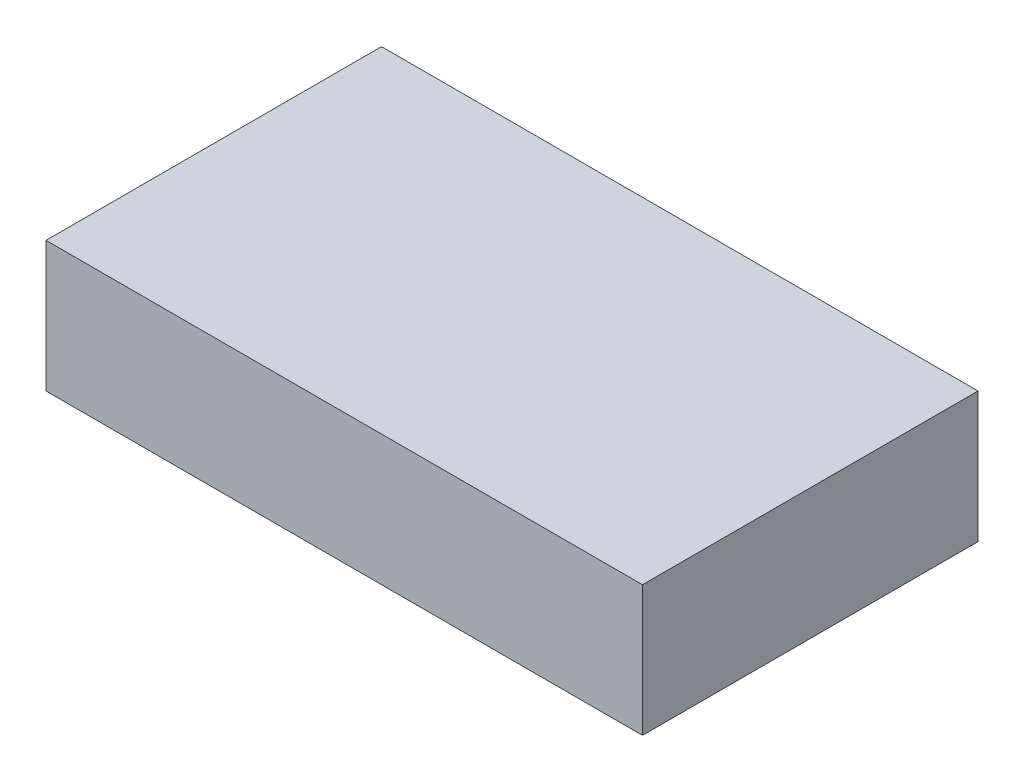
from build123d import *

# Parameters (mm, degrees)
SKETCH1_W           = 32
SKETCH1_H           = 18
BOSS_EXTRUDE1_DEPTH = 7


with BuildPart() as part:
    # Sketch1 → Boss-Extrude1 (new body)
    with BuildSketch(Plane(origin=(0, 0, 0), x_dir=(1, 0, 0), z_dir=(0, 1, 0))):
        Rectangle(SKETCH1_W, SKETCH1_H)
    extrude(amount=BOSS_EXTRUDE1_DEPTH)


solid = part.part
